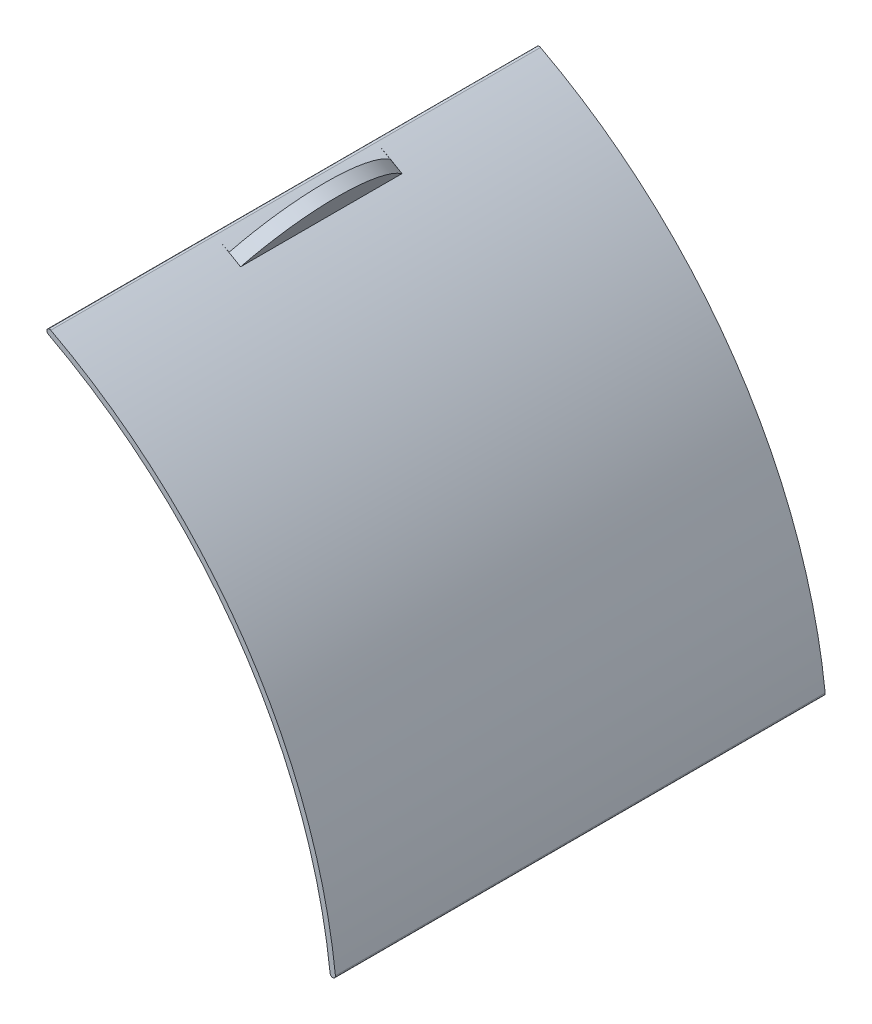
ISO-10303-21;
HEADER;
FILE_DESCRIPTION(('STEP AP214'),'2;1');
FILE_NAME('part.step','',(''),(''),'','','');
FILE_SCHEMA(('AUTOMOTIVE_DESIGN { 1 0 10303 214 1 1 1 1 }'));
ENDSEC;
DATA;
#1=APPLICATION_CONTEXT('core data for automotive mechanical design processes');
#2=APPLICATION_PROTOCOL_DEFINITION('international standard','automotive_design',2000,#1);
#3=PRODUCT_CONTEXT('',#1,'mechanical');
#4=PRODUCT('Part','Part','',(#3));
#5=PRODUCT_RELATED_PRODUCT_CATEGORY('part','',(#4));
#6=PRODUCT_DEFINITION_FORMATION('','',#4);
#7=PRODUCT_DEFINITION_CONTEXT('part definition',#1,'design');
#8=PRODUCT_DEFINITION('design','',#6,#7);
#9=PRODUCT_DEFINITION_SHAPE('','',#8);
#10=(LENGTH_UNIT() NAMED_UNIT(*) SI_UNIT(.MILLI.,.METRE.));
#11=(NAMED_UNIT(*) PLANE_ANGLE_UNIT() SI_UNIT($,.RADIAN.));
#12=(NAMED_UNIT(*) SI_UNIT($,.STERADIAN.) SOLID_ANGLE_UNIT());
#13=UNCERTAINTY_MEASURE_WITH_UNIT(LENGTH_MEASURE(1.E-05),#10,'distance_accuracy_value','');
#14=(GEOMETRIC_REPRESENTATION_CONTEXT(3) GLOBAL_UNCERTAINTY_ASSIGNED_CONTEXT((#13)) GLOBAL_UNIT_ASSIGNED_CONTEXT((#10,
#11,#12)) REPRESENTATION_CONTEXT('',''));
#15=CARTESIAN_POINT('',(0.,0.,0.));
#16=DIRECTION('',(0.,0.,1.));
#17=DIRECTION('',(1.,0.,0.));
#18=AXIS2_PLACEMENT_3D('',#15,#16,#17);
#19=CARTESIAN_POINT('',(0.,0.,185.69722044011));
#20=DIRECTION('',(0.,0.,-1.));
#21=DIRECTION('',(-1.,0.,0.));
#22=AXIS2_PLACEMENT_3D('',#19,#20,#21);
#23=CYLINDRICAL_SURFACE('',#22,99.);
#24=DIRECTION('',(0.,0.,1.));
#25=VECTOR('',#24,1.);
#26=CARTESIAN_POINT('',(94.510782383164,29.4739209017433,-500000.));
#27=LINE('',#26,#25);
#28=CARTESIAN_POINT('',(94.510782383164,29.4739209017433,11.9999999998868));
#29=VERTEX_POINT('',#28);
#30=CARTESIAN_POINT('',(94.510782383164,29.4739209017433,79.));
#31=VERTEX_POINT('',#30);
#32=EDGE_CURVE('E144',#29,#31,#27,.T.);
#33=ORIENTED_EDGE('',*,*,#32,.T.);
#34=CARTESIAN_POINT('',(0.,0.,79.));
#35=DIRECTION('',(0.,0.,1.));
#36=DIRECTION('',(1.,0.,0.));
#37=AXIS2_PLACEMENT_3D('',#34,#35,#36);
#38=CIRCLE('',#37,99.0000000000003);
#39=CARTESIAN_POINT('',(56.770888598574,81.1052785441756,79.));
#40=VERTEX_POINT('',#39);
#41=EDGE_CURVE('E156',#31,#40,#38,.T.);
#42=ORIENTED_EDGE('',*,*,#41,.T.);
#43=DIRECTION('',(0.,0.,1.));
#44=VECTOR('',#43,1.);
#45=CARTESIAN_POINT('',(56.770888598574,81.1052785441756,-500000.));
#46=LINE('',#45,#44);
#47=CARTESIAN_POINT('',(56.770888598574,81.1052785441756,11.9999999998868));
#48=VERTEX_POINT('',#47);
#49=EDGE_CURVE('E502',#48,#40,#46,.T.);
#50=ORIENTED_EDGE('',*,*,#49,.F.);
#51=CARTESIAN_POINT('',(0.,0.,12.));
#52=DIRECTION('',(0.,0.,1.));
#53=DIRECTION('',(1.,0.,0.));
#54=AXIS2_PLACEMENT_3D('',#51,#52,#53);
#55=CIRCLE('',#54,99.0000000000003);
#56=EDGE_CURVE('E158',#29,#48,#55,.T.);
#57=ORIENTED_EDGE('',*,*,#56,.F.);
#58=EDGE_LOOP('',(#33,#42,#50,#57));
#59=FACE_BOUND('',#58,.T.);
#60=ADVANCED_FACE('F32',(#59),#23,.F.);
#61=CARTESIAN_POINT('',(0.,0.,91.0000000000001));
#62=DIRECTION('',(0.,0.,1.));
#63=DIRECTION('',(1.,0.,0.));
#64=AXIS2_PLACEMENT_3D('',#61,#62,#63);
#65=CIRCLE('',#64,99.);
#66=CARTESIAN_POINT('',(46.0176293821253,87.654878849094,91.0000000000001));
#67=VERTEX_POINT('',#66);
#68=CARTESIAN_POINT('',(98.3872661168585,10.9975390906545,91.0000000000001));
#69=VERTEX_POINT('',#68);
#70=EDGE_CURVE('E246',#67,#69,#65,.F.);
#71=ORIENTED_EDGE('',*,*,#70,.F.);
#72=DIRECTION('',(0.,0.,-1.));
#73=VECTOR('',#72,1.);
#74=CARTESIAN_POINT('',(46.0176293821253,87.654878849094,185.69722044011));
#75=LINE('',#74,#73);
#76=CARTESIAN_POINT('',(46.0176293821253,87.654878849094,0.));
#77=VERTEX_POINT('',#76);
#78=EDGE_CURVE('E247',#67,#77,#75,.T.);
#79=ORIENTED_EDGE('',*,*,#78,.T.);
#80=CARTESIAN_POINT('',(0.,0.,0.));
#81=DIRECTION('',(0.,0.,-1.));
#82=DIRECTION('',(1.,0.,0.));
#83=AXIS2_PLACEMENT_3D('',#80,#81,#82);
#84=CIRCLE('',#83,99.);
#85=CARTESIAN_POINT('',(98.3872661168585,10.9975390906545,0.));
#86=VERTEX_POINT('',#85);
#87=EDGE_CURVE('E243',#77,#86,#84,.T.);
#88=ORIENTED_EDGE('',*,*,#87,.T.);
#89=DIRECTION('',(0.,0.,-1.));
#90=VECTOR('',#89,1.);
#91=CARTESIAN_POINT('',(98.3872661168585,10.9975390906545,185.69722044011));
#92=LINE('',#91,#90);
#93=EDGE_CURVE('E36',#69,#86,#92,.T.);
#94=ORIENTED_EDGE('',*,*,#93,.F.);
#95=EDGE_LOOP('',(#71,#79,#88,#94));
#96=FACE_BOUND('',#95,.T.);
#97=CARTESIAN_POINT('',(0.,0.,86.));
#98=DIRECTION('',(0.,0.,1.));
#99=DIRECTION('',(1.,0.,0.));
#100=AXIS2_PLACEMENT_3D('',#97,#98,#99);
#101=CIRCLE('',#100,99.0000000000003);
#102=CARTESIAN_POINT('',(98.0088237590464,13.9739209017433,86.));
#103=VERTEX_POINT('',#102);
#104=CARTESIAN_POINT('',(47.8616138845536,86.661790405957,86.));
#105=VERTEX_POINT('',#104);
#106=EDGE_CURVE('E504',#103,#105,#101,.T.);
#107=ORIENTED_EDGE('',*,*,#106,.F.);
#108=DIRECTION('',(0.,0.,-1.));
#109=VECTOR('',#108,1.);
#110=CARTESIAN_POINT('',(98.0088237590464,13.9739209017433,12.));
#111=LINE('',#110,#109);
#112=CARTESIAN_POINT('',(98.0088237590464,13.9739209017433,5.));
#113=VERTEX_POINT('',#112);
#114=EDGE_CURVE('E49',#103,#113,#111,.T.);
#115=ORIENTED_EDGE('',*,*,#114,.T.);
#116=CARTESIAN_POINT('',(0.,0.,5.));
#117=DIRECTION('',(0.,0.,1.));
#118=DIRECTION('',(1.,0.,0.));
#119=AXIS2_PLACEMENT_3D('',#116,#117,#118);
#120=CIRCLE('',#119,99.0000000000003);
#121=CARTESIAN_POINT('',(47.8616138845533,86.6617904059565,5.));
#122=VERTEX_POINT('',#121);
#123=EDGE_CURVE('E56',#113,#122,#120,.T.);
#124=ORIENTED_EDGE('',*,*,#123,.T.);
#125=DIRECTION('',(0.,0.,-1.));
#126=VECTOR('',#125,1.);
#127=CARTESIAN_POINT('',(47.8616138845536,86.661790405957,12.));
#128=LINE('',#127,#126);
#129=EDGE_CURVE('E191',#105,#122,#128,.T.);
#130=ORIENTED_EDGE('',*,*,#129,.F.);
#131=EDGE_LOOP('',(#107,#115,#124,#130));
#132=FACE_BOUND('',#131,.T.);
#133=ADVANCED_FACE('F269',(#96,#132),#23,.F.);
#134=CARTESIAN_POINT('',(0.,0.,12.));
#135=DIRECTION('',(0.,0.,1.));
#136=DIRECTION('',(1.,0.,0.));
#137=AXIS2_PLACEMENT_3D('',#134,#135,#136);
#138=PLANE('',#137);
#139=CARTESIAN_POINT('',(0.,0.,12.));
#140=DIRECTION('',(0.,0.,-1.));
#141=DIRECTION('',(1.,0.,0.));
#142=AXIS2_PLACEMENT_3D('',#139,#140,#141);
#143=CIRCLE('',#142,96.0000000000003);
#144=CARTESIAN_POINT('',(54.9012998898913,78.751808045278,11.9999999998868));
#145=VERTEX_POINT('',#144);
#146=CARTESIAN_POINT('',(91.6562640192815,28.5504687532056,11.9999999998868));
#147=VERTEX_POINT('',#146);
#148=EDGE_CURVE('E181',#145,#147,#143,.T.);
#149=ORIENTED_EDGE('',*,*,#148,.T.);
#150=DIRECTION('',(-0.951451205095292,-0.307799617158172,0.));
#151=VECTOR('',#150,1.);
#152=CARTESIAN_POINT('',(94.510782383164,29.4739209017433,12.0000000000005));
#153=LINE('',#152,#151);
#154=EDGE_CURVE('E493',#29,#147,#153,.T.);
#155=ORIENTED_EDGE('',*,*,#154,.F.);
#156=ORIENTED_EDGE('',*,*,#56,.T.);
#157=DIRECTION('',(0.62201603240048,0.7830045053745,0.));
#158=VECTOR('',#157,1.);
#159=CARTESIAN_POINT('',(56.770888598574,81.1052785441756,12.0000000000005));
#160=LINE('',#159,#158);
#161=EDGE_CURVE('E495',#145,#48,#160,.T.);
#162=ORIENTED_EDGE('',*,*,#161,.F.);
#163=EDGE_LOOP('',(#149,#155,#156,#162));
#164=FACE_BOUND('',#163,.T.);
#165=ADVANCED_FACE('F299',(#164),#138,.T.);
#166=CARTESIAN_POINT('',(0.,0.,79.));
#167=DIRECTION('',(0.,0.,-1.));
#168=DIRECTION('',(1.,0.,0.));
#169=AXIS2_PLACEMENT_3D('',#166,#167,#168);
#170=PLANE('',#169);
#171=ORIENTED_EDGE('',*,*,#41,.F.);
#172=DIRECTION('',(0.951451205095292,0.307799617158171,0.));
#173=VECTOR('',#172,1.);
#174=CARTESIAN_POINT('',(94.510782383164,29.4739209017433,79.));
#175=LINE('',#174,#173);
#176=CARTESIAN_POINT('',(91.6562640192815,28.5504687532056,79.));
#177=VERTEX_POINT('',#176);
#178=EDGE_CURVE('E141',#177,#31,#175,.T.);
#179=ORIENTED_EDGE('',*,*,#178,.F.);
#180=CARTESIAN_POINT('',(0.,0.,79.));
#181=DIRECTION('',(0.,0.,-1.));
#182=DIRECTION('',(1.,0.,0.));
#183=AXIS2_PLACEMENT_3D('',#180,#181,#182);
#184=CIRCLE('',#183,96.0000000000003);
#185=CARTESIAN_POINT('',(54.9012998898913,78.751808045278,79.));
#186=VERTEX_POINT('',#185);
#187=EDGE_CURVE('E164',#186,#177,#184,.T.);
#188=ORIENTED_EDGE('',*,*,#187,.F.);
#189=DIRECTION('',(-0.62201603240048,-0.7830045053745,0.));
#190=VECTOR('',#189,1.);
#191=CARTESIAN_POINT('',(56.770888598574,81.1052785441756,79.));
#192=LINE('',#191,#190);
#193=EDGE_CURVE('E163',#40,#186,#192,.T.);
#194=ORIENTED_EDGE('',*,*,#193,.F.);
#195=EDGE_LOOP('',(#171,#179,#188,#194));
#196=FACE_BOUND('',#195,.T.);
#197=ADVANCED_FACE('F161',(#196),#170,.T.);
#198=CARTESIAN_POINT('',(98.8841715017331,11.0530822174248,185.69722044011));
#199=DIRECTION('',(0.,0.,-1.));
#200=DIRECTION('',(-1.,0.,0.));
#201=AXIS2_PLACEMENT_3D('',#198,#199,#200);
#202=CYLINDRICAL_SURFACE('',#201,0.5);
#203=CARTESIAN_POINT('',(98.8841715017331,11.0530822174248,91.0000000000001));
#204=DIRECTION('',(0.,0.,1.));
#205=DIRECTION('',(1.,0.,0.));
#206=AXIS2_PLACEMENT_3D('',#203,#204,#205);
#207=CIRCLE('',#206,0.5);
#208=CARTESIAN_POINT('',(99.3810768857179,11.1086253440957,91.0000000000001));
#209=VERTEX_POINT('',#208);
#210=EDGE_CURVE('E261',#69,#209,#207,.T.);
#211=ORIENTED_EDGE('',*,*,#210,.F.);
#212=ORIENTED_EDGE('',*,*,#93,.T.);
#213=CARTESIAN_POINT('',(98.8841715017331,11.0530822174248,0.));
#214=DIRECTION('',(0.,0.,1.));
#215=DIRECTION('',(1.,0.,0.));
#216=AXIS2_PLACEMENT_3D('',#213,#214,#215);
#217=CIRCLE('',#216,0.5);
#218=CARTESIAN_POINT('',(99.3810768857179,11.1086253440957,0.));
#219=VERTEX_POINT('',#218);
#220=EDGE_CURVE('E256',#86,#219,#217,.T.);
#221=ORIENTED_EDGE('',*,*,#220,.T.);
#222=DIRECTION('',(0.,0.,-1.));
#223=VECTOR('',#222,1.);
#224=CARTESIAN_POINT('',(99.3810768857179,11.1086253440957,185.69722044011));
#225=LINE('',#224,#223);
#226=EDGE_CURVE('E255',#209,#219,#225,.T.);
#227=ORIENTED_EDGE('',*,*,#226,.F.);
#228=EDGE_LOOP('',(#211,#212,#221,#227));
#229=FACE_BOUND('',#228,.T.);
#230=ADVANCED_FACE('F282',(#229),#202,.T.);
#231=CARTESIAN_POINT('',(0.,0.,185.69722044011));
#232=DIRECTION('',(0.,0.,-1.));
#233=DIRECTION('',(-1.,0.,0.));
#234=AXIS2_PLACEMENT_3D('',#231,#232,#233);
#235=CYLINDRICAL_SURFACE('',#234,100.000000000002);
#236=DIRECTION('',(0.,0.,-1.));
#237=VECTOR('',#236,1.);
#238=CARTESIAN_POINT('',(49.0873561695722,87.1230822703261,60.5));
#239=LINE('',#238,#237);
#240=CARTESIAN_POINT('',(49.0873561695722,87.1230822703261,60.4673492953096));
#241=VERTEX_POINT('',#240);
#242=CARTESIAN_POINT('',(49.0873561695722,87.1230822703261,30.5326507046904));
#243=VERTEX_POINT('',#242);
#244=EDGE_CURVE('E237',#241,#243,#239,.T.);
#245=ORIENTED_EDGE('',*,*,#244,.T.);
#246=CARTESIAN_POINT('',(46.8939369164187,88.323035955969,30.5));
#247=CARTESIAN_POINT('',(47.6301907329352,87.9321281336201,30.5217671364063));
#248=CARTESIAN_POINT('',(48.3613304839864,87.5321435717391,30.5326507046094));
#249=CARTESIAN_POINT('',(49.8133818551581,86.7140209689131,30.5326507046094));
#250=CARTESIAN_POINT('',(50.5342934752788,86.295882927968,30.5217671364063));
#251=CARTESIAN_POINT('',(51.2500910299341,85.8686681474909,30.5));
#252=B_SPLINE_CURVE_WITH_KNOTS('',3,(#246,#247,#248,#249,#250,#251),.UNSPECIFIED.,.F.,.F.,(4,2,
4),(0.,2.50040855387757,5.00081710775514),.UNSPECIFIED.);
#253=CARTESIAN_POINT('',(46.8939369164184,88.3230359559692,30.5));
#254=VERTEX_POINT('',#253);
#255=EDGE_CURVE('E195',#254,#243,#252,.T.);
#256=ORIENTED_EDGE('',*,*,#255,.F.);
#257=CARTESIAN_POINT('',(0.,0.,30.5));
#258=DIRECTION('',(0.,0.,-1.));
#259=DIRECTION('',(1.,0.,0.));
#260=AXIS2_PLACEMENT_3D('',#257,#258,#259);
#261=CIRCLE('',#260,100.000000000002);
#262=CARTESIAN_POINT('',(51.2500910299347,85.8686681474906,30.5));
#263=VERTEX_POINT('',#262);
#264=EDGE_CURVE('E232',#254,#263,#261,.T.);
#265=ORIENTED_EDGE('',*,*,#264,.T.);
#266=DIRECTION('',(0.,0.,-1.));
#267=VECTOR('',#266,1.);
#268=CARTESIAN_POINT('',(51.2500910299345,85.8686681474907,60.5));
#269=LINE('',#268,#267);
#270=CARTESIAN_POINT('',(51.2500910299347,85.8686681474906,60.5));
#271=VERTEX_POINT('',#270);
#272=EDGE_CURVE('E240',#271,#263,#269,.T.);
#273=ORIENTED_EDGE('',*,*,#272,.F.);
#274=CARTESIAN_POINT('',(0.,0.,60.5));
#275=DIRECTION('',(0.,0.,-1.));
#276=DIRECTION('',(1.,0.,0.));
#277=AXIS2_PLACEMENT_3D('',#274,#275,#276);
#278=CIRCLE('',#277,100.000000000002);
#279=CARTESIAN_POINT('',(46.8939369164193,88.3230359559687,60.5));
#280=VERTEX_POINT('',#279);
#281=EDGE_CURVE('E235',#280,#271,#278,.T.);
#282=ORIENTED_EDGE('',*,*,#281,.F.);
#283=CARTESIAN_POINT('',(51.2500910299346,85.8686681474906,60.5));
#284=CARTESIAN_POINT('',(50.5342934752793,86.2958829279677,60.4782328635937));
#285=CARTESIAN_POINT('',(49.8133818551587,86.7140209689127,60.4673492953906));
#286=CARTESIAN_POINT('',(48.361330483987,87.5321435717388,60.4673492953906));
#287=CARTESIAN_POINT('',(47.6301907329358,87.9321281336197,60.4782328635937));
#288=CARTESIAN_POINT('',(46.8939369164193,88.3230359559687,60.5));
#289=B_SPLINE_CURVE_WITH_KNOTS('',3,(#283,#284,#285,#286,#287,#288),.UNSPECIFIED.,.F.,.F.,(4,2,
4),(0.,2.50040855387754,5.00081710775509),.UNSPECIFIED.);
#290=EDGE_CURVE('E203',#241,#280,#289,.T.);
#291=ORIENTED_EDGE('',*,*,#290,.F.);
#292=EDGE_LOOP('',(#245,#256,#265,#273,#282,#291));
#293=FACE_BOUND('',#292,.T.);
#294=CARTESIAN_POINT('',(0.,0.,91.0000000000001));
#295=DIRECTION('',(0.,0.,1.));
#296=DIRECTION('',(1.,0.,0.));
#297=AXIS2_PLACEMENT_3D('',#294,#295,#296);
#298=CIRCLE('',#297,100.000000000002);
#299=CARTESIAN_POINT('',(46.4824539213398,88.5402816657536,91.0000000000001));
#300=VERTEX_POINT('',#299);
#301=EDGE_CURVE('E41',#209,#300,#298,.T.);
#302=ORIENTED_EDGE('',*,*,#301,.F.);
#303=ORIENTED_EDGE('',*,*,#226,.T.);
#304=CARTESIAN_POINT('',(0.,0.,0.));
#305=DIRECTION('',(0.,0.,1.));
#306=DIRECTION('',(1.,0.,0.));
#307=AXIS2_PLACEMENT_3D('',#304,#305,#306);
#308=CIRCLE('',#307,100.000000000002);
#309=CARTESIAN_POINT('',(46.4824539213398,88.5402816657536,0.));
#310=VERTEX_POINT('',#309);
#311=EDGE_CURVE('E252',#219,#310,#308,.T.);
#312=ORIENTED_EDGE('',*,*,#311,.T.);
#313=DIRECTION('',(0.,0.,-1.));
#314=VECTOR('',#313,1.);
#315=CARTESIAN_POINT('',(46.4824539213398,88.5402816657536,185.69722044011));
#316=LINE('',#315,#314);
#317=EDGE_CURVE('E251',#300,#310,#316,.T.);
#318=ORIENTED_EDGE('',*,*,#317,.F.);
#319=EDGE_LOOP('',(#302,#303,#312,#318));
#320=FACE_BOUND('',#319,.T.);
#321=ADVANCED_FACE('F285',(#293,#320),#235,.T.);
#322=CARTESIAN_POINT('',(46.2500416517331,88.0975802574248,185.69722044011));
#323=DIRECTION('',(0.,0.,-1.));
#324=DIRECTION('',(-1.,0.,0.));
#325=AXIS2_PLACEMENT_3D('',#322,#323,#324);
#326=CYLINDRICAL_SURFACE('',#325,0.500000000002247);
#327=CARTESIAN_POINT('',(46.2500416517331,88.0975802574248,91.0000000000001));
#328=DIRECTION('',(0.,0.,1.));
#329=DIRECTION('',(1.,0.,0.));
#330=AXIS2_PLACEMENT_3D('',#327,#328,#329);
#331=CIRCLE('',#330,0.500000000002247);
#332=EDGE_CURVE('E11',#300,#67,#331,.T.);
#333=ORIENTED_EDGE('',*,*,#332,.F.);
#334=ORIENTED_EDGE('',*,*,#317,.T.);
#335=CARTESIAN_POINT('',(46.2500416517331,88.0975802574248,0.));
#336=DIRECTION('',(0.,0.,1.));
#337=DIRECTION('',(1.,0.,0.));
#338=AXIS2_PLACEMENT_3D('',#335,#336,#337);
#339=CIRCLE('',#338,0.500000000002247);
#340=EDGE_CURVE('E248',#310,#77,#339,.T.);
#341=ORIENTED_EDGE('',*,*,#340,.T.);
#342=ORIENTED_EDGE('',*,*,#78,.F.);
#343=EDGE_LOOP('',(#333,#334,#341,#342));
#344=FACE_BOUND('',#343,.T.);
#345=ADVANCED_FACE('F274',(#344),#326,.T.);
#346=CARTESIAN_POINT('',(49.4420857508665,5.5265411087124,0.));
#347=DIRECTION('',(0.,0.,1.));
#348=DIRECTION('',(1.,0.,0.));
#349=AXIS2_PLACEMENT_3D('',#346,#347,#348);
#350=PLANE('',#349);
#351=ORIENTED_EDGE('',*,*,#220,.F.);
#352=ORIENTED_EDGE('',*,*,#87,.F.);
#353=ORIENTED_EDGE('',*,*,#340,.F.);
#354=ORIENTED_EDGE('',*,*,#311,.F.);
#355=EDGE_LOOP('',(#351,#352,#353,#354));
#356=FACE_BOUND('',#355,.T.);
#357=ADVANCED_FACE('F278',(#356),#350,.F.);
#358=CARTESIAN_POINT('',(77.8849769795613,92.5907891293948,91.0000000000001));
#359=DIRECTION('',(0.,0.,1.));
#360=DIRECTION('',(1.,0.,0.));
#361=AXIS2_PLACEMENT_3D('',#358,#359,#360);
#362=PLANE('',#361);
#363=ORIENTED_EDGE('',*,*,#70,.T.);
#364=ORIENTED_EDGE('',*,*,#210,.T.);
#365=ORIENTED_EDGE('',*,*,#301,.T.);
#366=ORIENTED_EDGE('',*,*,#332,.T.);
#367=EDGE_LOOP('',(#363,#364,#365,#366));
#368=FACE_BOUND('',#367,.T.);
#369=ADVANCED_FACE('F34',(#368),#362,.T.);
#370=CARTESIAN_POINT('',(51.2500910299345,85.8686681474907,60.5));
#371=DIRECTION('',(-0.871230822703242,0.49087356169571,0.));
#372=DIRECTION('',(-0.49087356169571,-0.871230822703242,0.));
#373=AXIS2_PLACEMENT_3D('',#370,#371,#372);
#374=PLANE('',#373);
#375=ORIENTED_EDGE('',*,*,#272,.T.);
#376=CARTESIAN_POINT('',(43.5741994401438,72.2450512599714,45.5));
#377=DIRECTION('',(-0.871230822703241,0.490873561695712,0.));
#378=DIRECTION('',(-0.490873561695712,-0.871230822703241,0.));
#379=AXIS2_PLACEMENT_3D('',#376,#377,#378);
#380=CIRCLE('',#379,21.6684620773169);
#381=EDGE_CURVE('E227',#271,#263,#380,.T.);
#382=ORIENTED_EDGE('',*,*,#381,.F.);
#383=EDGE_LOOP('',(#375,#382));
#384=FACE_BOUND('',#383,.T.);
#385=ADVANCED_FACE('F303',(#384),#374,.F.);
#386=CARTESIAN_POINT('',(49.0873561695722,87.1230822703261,60.5));
#387=DIRECTION('',(0.871230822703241,-0.490873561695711,0.));
#388=DIRECTION('',(0.490873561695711,0.871230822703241,0.));
#389=AXIS2_PLACEMENT_3D('',#386,#387,#388);
#390=PLANE('',#389);
#391=CARTESIAN_POINT('',(41.3961223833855,73.4722351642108,45.5));
#392=DIRECTION('',(0.871230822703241,-0.490873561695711,0.));
#393=DIRECTION('',(0.490873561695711,0.871230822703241,0.));
#394=AXIS2_PLACEMENT_3D('',#391,#392,#393);
#395=CIRCLE('',#394,21.6684620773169);
#396=EDGE_CURVE('E225',#243,#241,#395,.T.);
#397=ORIENTED_EDGE('',*,*,#396,.F.);
#398=ORIENTED_EDGE('',*,*,#244,.F.);
#399=EDGE_LOOP('',(#397,#398));
#400=FACE_BOUND('',#399,.T.);
#401=ADVANCED_FACE('F305',(#400),#390,.F.);
#402=CARTESIAN_POINT('',(44.3020962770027,89.7833447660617,60.5));
#403=DIRECTION('',(0.,0.,1.));
#404=DIRECTION('',(0.,-1.,0.));
#405=AXIS2_PLACEMENT_3D('',#402,#403,#404);
#406=PLANE('',#405);
#407=DIRECTION('',(0.871230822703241,-0.490873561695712,0.));
#408=VECTOR('',#407,1.);
#409=CARTESIAN_POINT('',(44.3020962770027,89.7833447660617,60.5));
#410=LINE('',#409,#408);
#411=EDGE_CURVE('E229',#280,#271,#410,.T.);
#412=ORIENTED_EDGE('',*,*,#411,.F.);
#413=ORIENTED_EDGE('',*,*,#281,.T.);
#414=EDGE_LOOP('',(#412,#413));
#415=FACE_BOUND('',#414,.T.);
#416=ADVANCED_FACE('F219',(#415),#406,.F.);
#417=CARTESIAN_POINT('',(36.6262046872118,76.1597278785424,45.5));
#418=DIRECTION('',(0.871230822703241,-0.490873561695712,0.));
#419=DIRECTION('',(0.490873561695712,0.871230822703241,0.));
#420=AXIS2_PLACEMENT_3D('',#417,#418,#419);
#421=CYLINDRICAL_SURFACE('',#420,21.6684620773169);
#422=ORIENTED_EDGE('',*,*,#396,.T.);
#423=ORIENTED_EDGE('',*,*,#290,.T.);
#424=ORIENTED_EDGE('',*,*,#411,.T.);
#425=ORIENTED_EDGE('',*,*,#381,.T.);
#426=DIRECTION('',(0.871230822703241,-0.490873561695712,0.));
#427=VECTOR('',#426,1.);
#428=CARTESIAN_POINT('',(44.3020962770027,89.7833447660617,30.5));
#429=LINE('',#428,#427);
#430=EDGE_CURVE('E194',#254,#263,#429,.T.);
#431=ORIENTED_EDGE('',*,*,#430,.F.);
#432=ORIENTED_EDGE('',*,*,#255,.T.);
#433=EDGE_LOOP('',(#422,#423,#424,#425,#431,#432));
#434=FACE_BOUND('',#433,.T.);
#435=ADVANCED_FACE('F205',(#434),#421,.T.);
#436=CARTESIAN_POINT('',(44.3020962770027,89.7833447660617,30.5));
#437=DIRECTION('',(0.,0.,-1.));
#438=DIRECTION('',(0.,1.,0.));
#439=AXIS2_PLACEMENT_3D('',#436,#437,#438);
#440=PLANE('',#439);
#441=ORIENTED_EDGE('',*,*,#264,.F.);
#442=ORIENTED_EDGE('',*,*,#430,.T.);
#443=EDGE_LOOP('',(#441,#442));
#444=FACE_BOUND('',#443,.T.);
#445=ADVANCED_FACE('F214',(#444),#440,.F.);
#446=CARTESIAN_POINT('',(47.8616138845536,86.661790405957,12.));
#447=DIRECTION('',(0.875371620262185,-0.483450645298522,0.));
#448=DIRECTION('',(0.483450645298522,0.875371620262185,0.));
#449=AXIS2_PLACEMENT_3D('',#446,#447,#448);
#450=PLANE('',#449);
#451=DIRECTION('',(-0.483450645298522,-0.875371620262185,0.));
#452=VECTOR('',#451,1.);
#453=CARTESIAN_POINT('',(47.8616138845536,86.661790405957,5.));
#454=LINE('',#453,#452);
#455=CARTESIAN_POINT('',(46.4112619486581,84.0356755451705,5.));
#456=VERTEX_POINT('',#455);
#457=EDGE_CURVE('E174',#122,#456,#454,.T.);
#458=ORIENTED_EDGE('',*,*,#457,.T.);
#459=DIRECTION('',(0.,0.,-1.));
#460=VECTOR('',#459,1.);
#461=CARTESIAN_POINT('',(46.4112619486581,84.0356755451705,12.));
#462=LINE('',#461,#460);
#463=CARTESIAN_POINT('',(46.4112619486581,84.0356755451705,86.));
#464=VERTEX_POINT('',#463);
#465=EDGE_CURVE('E188',#464,#456,#462,.T.);
#466=ORIENTED_EDGE('',*,*,#465,.F.);
#467=DIRECTION('',(-0.483450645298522,-0.875371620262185,0.));
#468=VECTOR('',#467,1.);
#469=CARTESIAN_POINT('',(47.8616138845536,86.661790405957,86.));
#470=LINE('',#469,#468);
#471=EDGE_CURVE('E165',#105,#464,#470,.T.);
#472=ORIENTED_EDGE('',*,*,#471,.F.);
#473=ORIENTED_EDGE('',*,*,#129,.T.);
#474=EDGE_LOOP('',(#458,#466,#472,#473));
#475=FACE_BOUND('',#474,.T.);
#476=ADVANCED_FACE('F212',(#475),#450,.F.);
#477=CARTESIAN_POINT('',(0.,0.,12.));
#478=DIRECTION('',(0.,0.,-1.));
#479=DIRECTION('',(-1.,0.,0.));
#480=AXIS2_PLACEMENT_3D('',#477,#478,#479);
#481=CYLINDRICAL_SURFACE('',#480,96.0000000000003);
#482=DIRECTION('',(0.,0.,-1.));
#483=VECTOR('',#482,1.);
#484=CARTESIAN_POINT('',(95.038859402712,13.5504687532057,12.));
#485=LINE('',#484,#483);
#486=CARTESIAN_POINT('',(95.038859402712,13.5504687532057,86.));
#487=VERTEX_POINT('',#486);
#488=CARTESIAN_POINT('',(95.038859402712,13.5504687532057,5.));
#489=VERTEX_POINT('',#488);
#490=EDGE_CURVE('E185',#487,#489,#485,.T.);
#491=ORIENTED_EDGE('',*,*,#490,.F.);
#492=CARTESIAN_POINT('',(0.,0.,86.));
#493=DIRECTION('',(0.,0.,-1.));
#494=DIRECTION('',(1.,0.,0.));
#495=AXIS2_PLACEMENT_3D('',#492,#493,#494);
#496=CIRCLE('',#495,96.0000000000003);
#497=EDGE_CURVE('E169',#464,#487,#496,.T.);
#498=ORIENTED_EDGE('',*,*,#497,.F.);
#499=ORIENTED_EDGE('',*,*,#465,.T.);
#500=CARTESIAN_POINT('',(0.,0.,5.));
#501=DIRECTION('',(0.,0.,-1.));
#502=DIRECTION('',(1.,0.,0.));
#503=AXIS2_PLACEMENT_3D('',#500,#501,#502);
#504=CIRCLE('',#503,96.0000000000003);
#505=EDGE_CURVE('E176',#456,#489,#504,.T.);
#506=ORIENTED_EDGE('',*,*,#505,.T.);
#507=EDGE_LOOP('',(#491,#498,#499,#506));
#508=FACE_BOUND('',#507,.T.);
#509=DIRECTION('',(0.,0.,1.));
#510=VECTOR('',#509,1.);
#511=CARTESIAN_POINT('',(91.6562640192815,28.5504687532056,-500000.));
#512=LINE('',#511,#510);
#513=EDGE_CURVE('E147',#147,#177,#512,.T.);
#514=ORIENTED_EDGE('',*,*,#513,.F.);
#515=ORIENTED_EDGE('',*,*,#148,.F.);
#516=DIRECTION('',(0.,0.,1.));
#517=VECTOR('',#516,1.);
#518=CARTESIAN_POINT('',(54.9012998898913,78.751808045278,-500000.));
#519=LINE('',#518,#517);
#520=EDGE_CURVE('E497',#145,#186,#519,.T.);
#521=ORIENTED_EDGE('',*,*,#520,.T.);
#522=ORIENTED_EDGE('',*,*,#187,.T.);
#523=EDGE_LOOP('',(#514,#515,#521,#522));
#524=FACE_BOUND('',#523,.T.);
#525=ADVANCED_FACE('F338',(#508,#524),#481,.F.);
#526=CARTESIAN_POINT('',(98.0088237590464,13.9739209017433,12.));
#527=DIRECTION('',(-0.141150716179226,0.989988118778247,0.));
#528=DIRECTION('',(-0.989988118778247,-0.141150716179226,0.));
#529=AXIS2_PLACEMENT_3D('',#526,#527,#528);
#530=PLANE('',#529);
#531=DIRECTION('',(0.989988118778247,0.141150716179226,0.));
#532=VECTOR('',#531,1.);
#533=CARTESIAN_POINT('',(98.0088237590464,13.9739209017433,5.));
#534=LINE('',#533,#532);
#535=EDGE_CURVE('E178',#489,#113,#534,.T.);
#536=ORIENTED_EDGE('',*,*,#535,.T.);
#537=ORIENTED_EDGE('',*,*,#114,.F.);
#538=DIRECTION('',(0.989988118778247,0.141150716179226,0.));
#539=VECTOR('',#538,1.);
#540=CARTESIAN_POINT('',(98.0088237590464,13.9739209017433,86.));
#541=LINE('',#540,#539);
#542=EDGE_CURVE('E509',#487,#103,#541,.T.);
#543=ORIENTED_EDGE('',*,*,#542,.F.);
#544=ORIENTED_EDGE('',*,*,#490,.T.);
#545=EDGE_LOOP('',(#536,#537,#543,#544));
#546=FACE_BOUND('',#545,.T.);
#547=ADVANCED_FACE('F346',(#546),#530,.F.);
#548=CARTESIAN_POINT('',(0.,0.,5.));
#549=DIRECTION('',(0.,0.,1.));
#550=DIRECTION('',(1.,0.,0.));
#551=AXIS2_PLACEMENT_3D('',#548,#549,#550);
#552=PLANE('',#551);
#553=ORIENTED_EDGE('',*,*,#123,.F.);
#554=ORIENTED_EDGE('',*,*,#535,.F.);
#555=ORIENTED_EDGE('',*,*,#505,.F.);
#556=ORIENTED_EDGE('',*,*,#457,.F.);
#557=EDGE_LOOP('',(#553,#554,#555,#556));
#558=FACE_BOUND('',#557,.T.);
#559=ADVANCED_FACE('F353',(#558),#552,.F.);
#560=CARTESIAN_POINT('',(0.,0.,86.));
#561=DIRECTION('',(0.,0.,-1.));
#562=DIRECTION('',(1.,0.,0.));
#563=AXIS2_PLACEMENT_3D('',#560,#561,#562);
#564=PLANE('',#563);
#565=ORIENTED_EDGE('',*,*,#106,.T.);
#566=ORIENTED_EDGE('',*,*,#471,.T.);
#567=ORIENTED_EDGE('',*,*,#497,.T.);
#568=ORIENTED_EDGE('',*,*,#542,.T.);
#569=EDGE_LOOP('',(#565,#566,#567,#568));
#570=FACE_BOUND('',#569,.T.);
#571=ADVANCED_FACE('F360',(#570),#564,.F.);
#572=CARTESIAN_POINT('',(56.770888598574,81.1052785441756,-500000.));
#573=DIRECTION('',(-0.7830045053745,0.62201603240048,0.));
#574=DIRECTION('',(-0.62201603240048,-0.7830045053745,0.));
#575=AXIS2_PLACEMENT_3D('',#572,#573,#574);
#576=PLANE('',#575);
#577=ORIENTED_EDGE('',*,*,#520,.F.);
#578=ORIENTED_EDGE('',*,*,#161,.T.);
#579=ORIENTED_EDGE('',*,*,#49,.T.);
#580=ORIENTED_EDGE('',*,*,#193,.T.);
#581=EDGE_LOOP('',(#577,#578,#579,#580));
#582=FACE_BOUND('',#581,.T.);
#583=ADVANCED_FACE('F368',(#582),#576,.F.);
#584=CARTESIAN_POINT('',(94.510782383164,29.4739209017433,-500000.));
#585=DIRECTION('',(0.307799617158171,-0.951451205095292,0.));
#586=DIRECTION('',(0.951451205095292,0.307799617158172,0.));
#587=AXIS2_PLACEMENT_3D('',#584,#585,#586);
#588=PLANE('',#587);
#589=ORIENTED_EDGE('',*,*,#32,.F.);
#590=ORIENTED_EDGE('',*,*,#154,.T.);
#591=ORIENTED_EDGE('',*,*,#513,.T.);
#592=ORIENTED_EDGE('',*,*,#178,.T.);
#593=EDGE_LOOP('',(#589,#590,#591,#592));
#594=FACE_BOUND('',#593,.T.);
#595=ADVANCED_FACE('F143',(#594),#588,.F.);
#596=CLOSED_SHELL('',(#60,#133,#165,#197,#230,#321,#345,#357,#369,#385,#401,#416,#435,#445,#476,
#525,#547,#559,#571,#583,#595));
#597=MANIFOLD_SOLID_BREP('B2',#596);
#598=ADVANCED_BREP_SHAPE_REPRESENTATION('',(#18,#597),#14);
#599=SHAPE_DEFINITION_REPRESENTATION(#9,#598);
ENDSEC;
END-ISO-10303-21;
